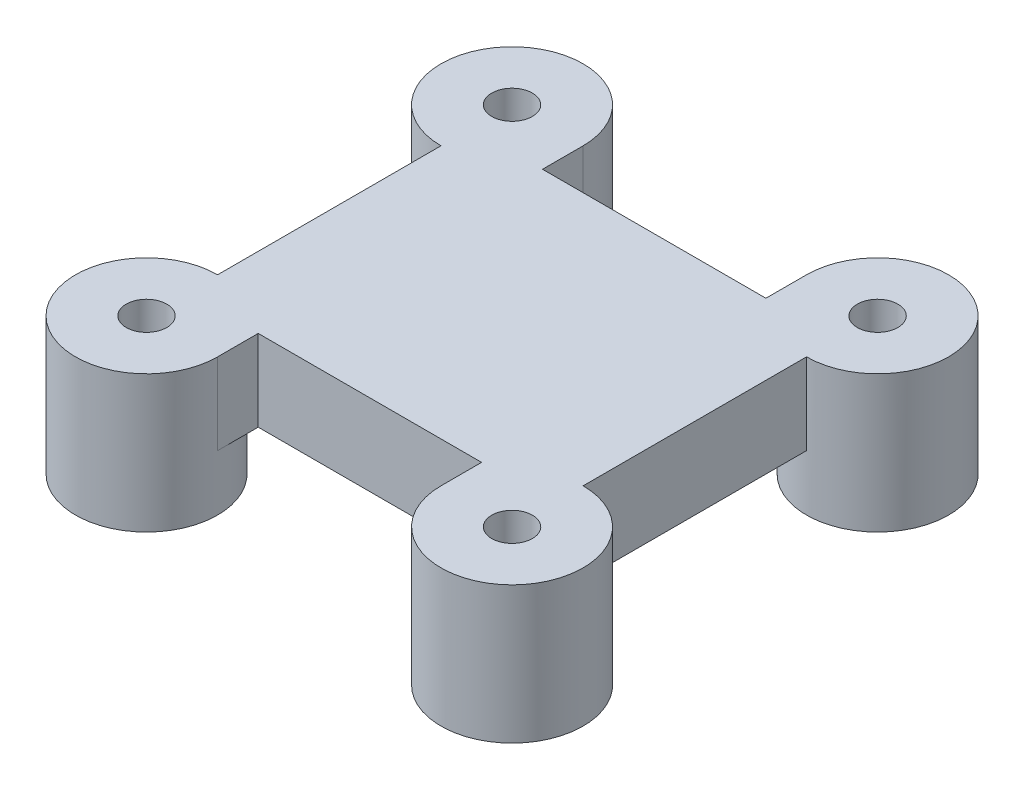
from build123d import *

# Parameters (mm, degrees)
SKETCH1_W           = 22
SKETCH1_H           = 28
BOSS_EXTRUDE1_DEPTH = 8
SKETCH2_R           = 2
CUT_EXTRUDE1_DEPTH  = 37.249137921
SKETCH5_R           = 7
SKETCH5_R_2         = 2
BOSS_EXTRUDE3_DEPTH = 5.5


with BuildPart() as part:
    # Sketch1 → Boss-Extrude1 (new body)
    with BuildSketch(Plane(origin=(0, 0, 0), x_dir=(1, 0, 0), z_dir=(0, 1, 0))):
        with BuildLine():
            ThreePointArc((-18, 11), (-13.050252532, 13.050252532), (-11, 18))
            Line((-11, 18), (-18, 18))
            Line((-18, 18), (-18, 11))
        make_face()
        with BuildLine():
            Line((-18, 18), (-11, 18))
            ThreePointArc((-11, 18), (-22.949747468, 22.949747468), (-18, 11))
            Line((-18, 11), (-18, 18))
        make_face()
        with BuildLine():
            ThreePointArc((-18, 11), (-13.050252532, 13.050252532), (-11, 18))
            Line((-11, 18), (-18, 18))
            Line((-18, 18), (-18, 11))
        make_face()
        with BuildLine():
            Line((-18, 18), (-11, 18))
            ThreePointArc((-11, 18), (-22.949747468, 22.949747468), (-18, 11))
            Line((-18, 11), (-18, 18))
        make_face()
        with BuildLine():
            Line((-11, -18), (-11, -14))
            Line((-11, -14), (-11, 14))
            Line((-11, 14), (-11, 18))
            ThreePointArc((-11, 18), (-13.050252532, 13.050252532), (-18, 11))
            Line((-18, 11), (-18, -11))
            ThreePointArc((-18, -11), (-13.050252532, -13.050252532), (-11, -18))
        make_face()
        with BuildLine():
            ThreePointArc((-18, -11), (-22.949747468, -22.949747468), (-11, -18))
            Line((-11, -18), (-18, -18))
            Line((-18, -18), (-18, -11))
        make_face()
        with BuildLine():
            Line((-18, -18), (-11, -18))
            ThreePointArc((-11, -18), (-13.050252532, -13.050252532), (-18, -11))
            Line((-18, -11), (-18, -18))
        make_face()
        with BuildLine():
            ThreePointArc((-18, -11), (-22.949747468, -22.949747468), (-11, -18))
            Line((-11, -18), (-18, -18))
            Line((-18, -18), (-18, -11))
        make_face()
        with BuildLine():
            Line((-18, -18), (-11, -18))
            ThreePointArc((-11, -18), (-13.050252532, -13.050252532), (-18, -11))
            Line((-18, -11), (-18, -18))
        make_face()
        Rectangle(SKETCH1_W, SKETCH1_H)
        with BuildLine():
            ThreePointArc((18, -11), (13.050252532, -13.050252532), (11, -18))
            Line((11, -18), (18, -18))
            Line((18, -18), (18, -11))
        make_face()
        with BuildLine():
            Line((18, -18), (11, -18))
            ThreePointArc((11, -18), (18, -25), (25, -18))
            ThreePointArc((25, -18), (22.949747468, -13.050252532), (18, -11))
            Line((18, -11), (18, -18))
        make_face()
        with BuildLine():
            Line((11, 14), (11, -14))
            Line((11, -14), (11, -18))
            ThreePointArc((11, -18), (13.050252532, -13.050252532), (18, -11))
            Line((18, -11), (18, 11))
            ThreePointArc((18, 11), (13.050252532, 13.050252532), (11, 18))
            Line((11, 18), (11, 14))
        make_face()
        with BuildLine():
            ThreePointArc((25, 18), (18, 25), (11, 18))
            Line((11, 18), (18, 18))
            Line((18, 18), (18, 11))
            ThreePointArc((18, 11), (22.949747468, 13.050252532), (25, 18))
        make_face()
        with BuildLine():
            Line((18, 18), (11, 18))
            ThreePointArc((11, 18), (13.050252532, 13.050252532), (18, 11))
            Line((18, 11), (18, 18))
        make_face()
        with BuildLine():
            ThreePointArc((25, 18), (18, 25), (11, 18))
            Line((11, 18), (18, 18))
            Line((18, 18), (18, 11))
            ThreePointArc((18, 11), (22.949747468, 13.050252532), (25, 18))
        make_face()
        with BuildLine():
            Line((18, 18), (11, 18))
            ThreePointArc((11, 18), (13.050252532, 13.050252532), (18, 11))
            Line((18, 11), (18, 18))
        make_face()
        with BuildLine():
            ThreePointArc((18, -11), (13.050252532, -13.050252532), (11, -18))
            Line((11, -18), (18, -18))
            Line((18, -18), (18, -11))
        make_face()
        with BuildLine():
            Line((18, -18), (11, -18))
            ThreePointArc((11, -18), (18, -25), (25, -18))
            ThreePointArc((25, -18), (22.949747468, -13.050252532), (18, -11))
            Line((18, -11), (18, -18))
        make_face()
    extrude(amount=BOSS_EXTRUDE1_DEPTH)

    # Sketch2 → Cut-Extrude1 (cut, through all)
    with BuildSketch(Plane(origin=(0, 8, 0), x_dir=(1, 0, 0), z_dir=(0, 1, 0))):
        with Locations(Location((-18, 18, 0), (0, 0, 270))):
            Circle(SKETCH2_R)
        with Locations(Location((-18, -18, 0), (0, 0, 270))):
            Circle(SKETCH2_R)
        with Locations(Location((18, -18, 0), (0, 0, 270))):
            Circle(SKETCH2_R)
        with Locations(Location((18, 18, 0), (0, 0, 270))):
            Circle(SKETCH2_R)
    extrude(amount=-CUT_EXTRUDE1_DEPTH, mode=Mode.SUBTRACT)

    # Sketch5 → Boss-Extrude3 (add)
    # profile 1 of 4: a face of its own
    with BuildSketch(Plane.XZ):
        with Locations(Location((-18, 18, 0), (0, 0, 270))):
            Circle(SKETCH5_R)
        with Locations(Location((-18, 18, 0), (0, 0, 90))):
            Circle(SKETCH5_R_2, mode=Mode.SUBTRACT)
    # profile 2 of 4: a face of its own
    with BuildSketch(Plane.XZ):
        with Locations(Location((18, 18, 0), (0, 0, 270))):
            Circle(SKETCH5_R)
        with Locations(Location((18, 18, 0), (0, 0, 90))):
            Circle(SKETCH5_R_2, mode=Mode.SUBTRACT)
    # profile 3 of 4: a face of its own
    with BuildSketch(Plane.XZ):
        with Locations(Location((18, -18, 0), (0, 0, 270))):
            Circle(SKETCH5_R)
        with Locations(Location((18, -18, 0), (0, 0, 90))):
            Circle(SKETCH5_R_2, mode=Mode.SUBTRACT)
    # profile 4 of 4: a face of its own
    with BuildSketch(Plane.XZ):
        with Locations(Location((-18, -18, 0), (0, 0, 270))):
            Circle(SKETCH5_R)
        with Locations(Location((-18, -18, 0), (0, 0, 90))):
            Circle(SKETCH5_R_2, mode=Mode.SUBTRACT)
    extrude(amount=BOSS_EXTRUDE3_DEPTH)


solid = part.part
